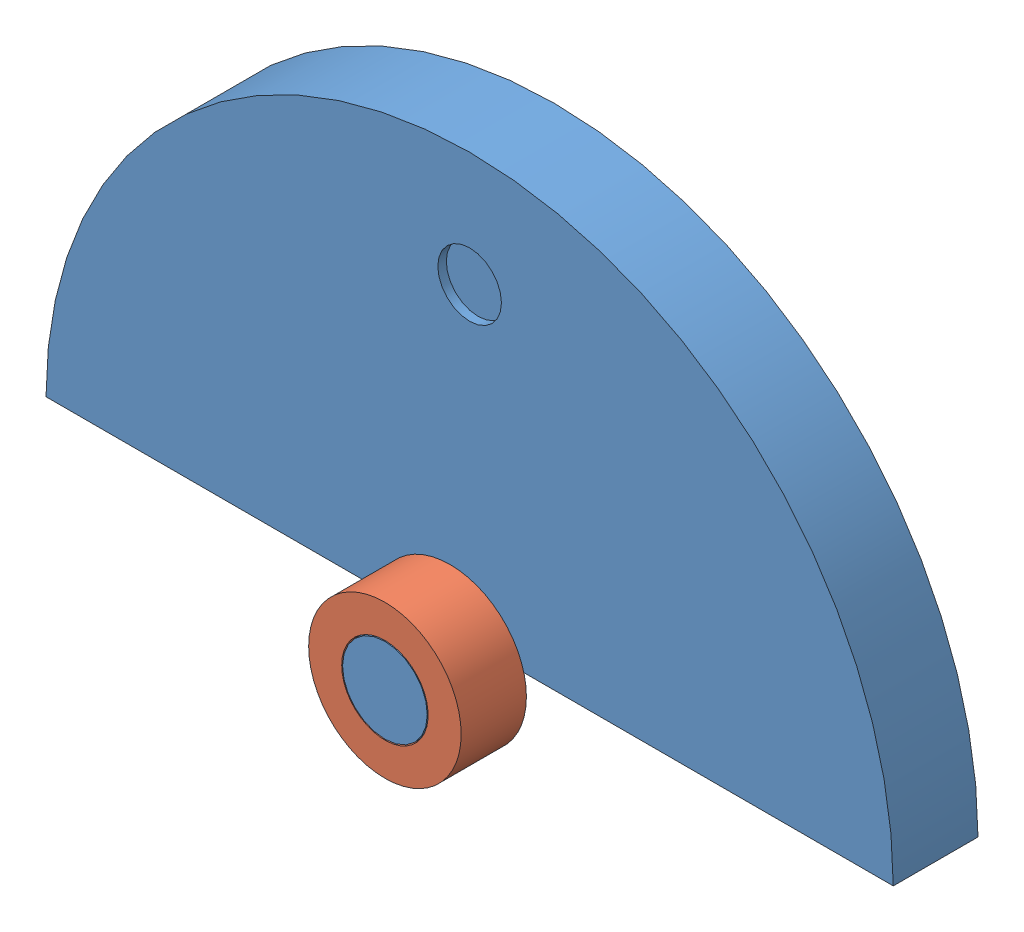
SolidWorks assembly DemiCylindrePleinPlat.SLDASM, configuration Défaut (file format 7000). Lengths in mm.
Overall size (1000 590 200).
2 component instances, 2 part files, 2 mates.
Components (placement in the parent):
- DemiCyclindrePleinPlat-1: DemiCyclindrePleinPlat.SLDPRT [Défaut] at (142.7978 -195.3771 900) size (1000 550 200)
- Support-1: Support.SLDPRT [Défaut] at (142.7978 -195.3771 1023) size (180 180 77)
Mates (geometry in assembly coordinates):
- Coaxiale1: concentric aligned: cylinder of DemiCyclindrePleinPlat-1 through (142.7978 -195.3771 1100) axis (0 0 -1) radius 50; cylinder of Support-1 through (142.7978 -195.3771 1100) axis (0 0 -1) radius 51
- Coïncidente2: coincident aligned: plane of DemiCyclindrePleinPlat-1 through (142.7978 -195.3771 1100) normal (0 0 1); plane of Support-1 through (142.7978 -195.3771 1100) normal (0 0 1)
